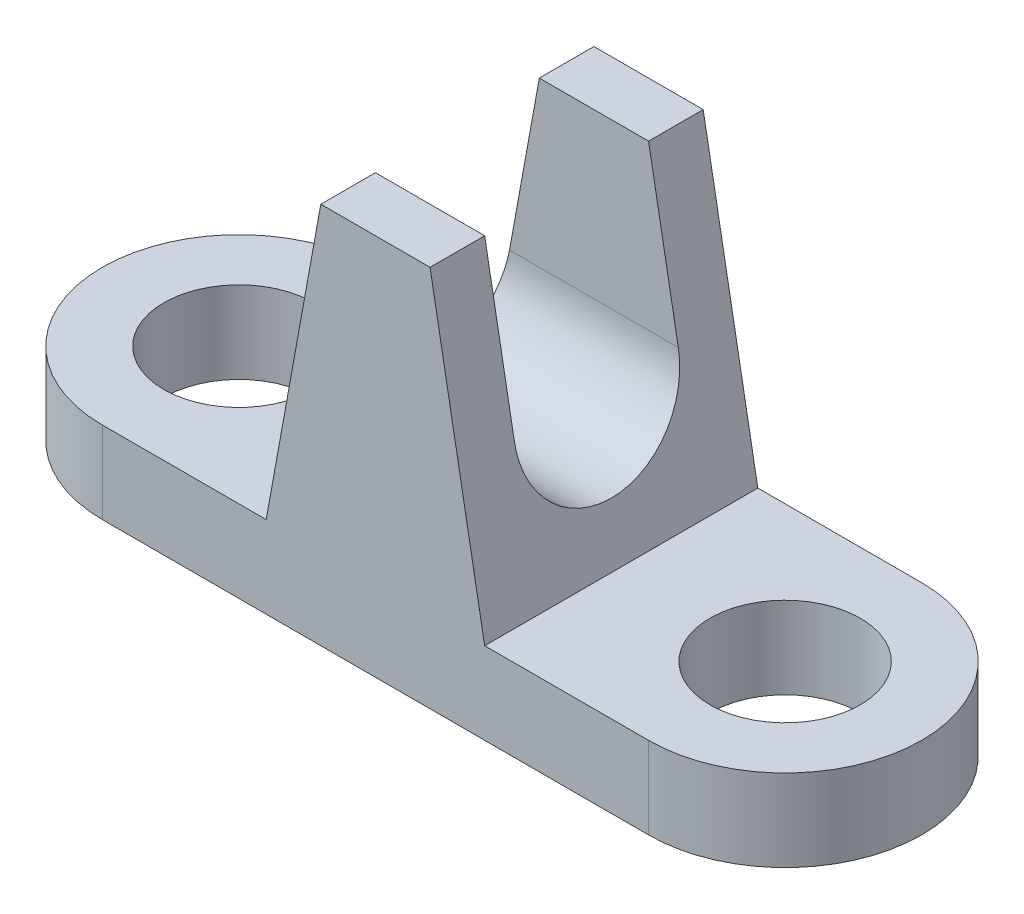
ISO-10303-21;
HEADER;
FILE_DESCRIPTION(('STEP AP214'),'2;1');
FILE_NAME('part.step','',(''),(''),'','','');
FILE_SCHEMA(('AUTOMOTIVE_DESIGN { 1 0 10303 214 1 1 1 1 }'));
ENDSEC;
DATA;
#1=APPLICATION_CONTEXT('core data for automotive mechanical design processes');
#2=APPLICATION_PROTOCOL_DEFINITION('international standard','automotive_design',2000,#1);
#3=PRODUCT_CONTEXT('',#1,'mechanical');
#4=PRODUCT('Part','Part','',(#3));
#5=PRODUCT_RELATED_PRODUCT_CATEGORY('part','',(#4));
#6=PRODUCT_DEFINITION_FORMATION('','',#4);
#7=PRODUCT_DEFINITION_CONTEXT('part definition',#1,'design');
#8=PRODUCT_DEFINITION('design','',#6,#7);
#9=PRODUCT_DEFINITION_SHAPE('','',#8);
#10=(LENGTH_UNIT() NAMED_UNIT(*) SI_UNIT(.MILLI.,.METRE.));
#11=(NAMED_UNIT(*) PLANE_ANGLE_UNIT() SI_UNIT($,.RADIAN.));
#12=(NAMED_UNIT(*) SI_UNIT($,.STERADIAN.) SOLID_ANGLE_UNIT());
#13=UNCERTAINTY_MEASURE_WITH_UNIT(LENGTH_MEASURE(1.E-05),#10,'distance_accuracy_value','');
#14=(GEOMETRIC_REPRESENTATION_CONTEXT(3) GLOBAL_UNCERTAINTY_ASSIGNED_CONTEXT((#13)) GLOBAL_UNIT_ASSIGNED_CONTEXT((#10,
#11,#12)) REPRESENTATION_CONTEXT('',''));
#15=CARTESIAN_POINT('',(0.,0.,0.));
#16=DIRECTION('',(0.,0.,1.));
#17=DIRECTION('',(1.,0.,0.));
#18=AXIS2_PLACEMENT_3D('',#15,#16,#17);
#19=CARTESIAN_POINT('',(8.,56.,20.));
#20=DIRECTION('',(0.,-1.,0.));
#21=DIRECTION('',(1.,0.,0.));
#22=AXIS2_PLACEMENT_3D('',#19,#20,#21);
#23=PLANE('',#22);
#24=DIRECTION('',(0.,0.,-1.));
#25=VECTOR('',#24,1.);
#26=CARTESIAN_POINT('',(8.,56.,20.));
#27=LINE('',#26,#25);
#28=CARTESIAN_POINT('',(8.,56.,20.));
#29=VERTEX_POINT('',#28);
#30=CARTESIAN_POINT('',(8.,56.,12.));
#31=VERTEX_POINT('',#30);
#32=EDGE_CURVE('E159',#29,#31,#27,.T.);
#33=ORIENTED_EDGE('',*,*,#32,.T.);
#34=DIRECTION('',(-1.,0.,0.));
#35=VECTOR('',#34,1.);
#36=CARTESIAN_POINT('',(8.,56.,12.));
#37=LINE('',#36,#35);
#38=CARTESIAN_POINT('',(-8.,56.,12.));
#39=VERTEX_POINT('',#38);
#40=EDGE_CURVE('E41',#31,#39,#37,.T.);
#41=ORIENTED_EDGE('',*,*,#40,.T.);
#42=DIRECTION('',(0.,0.,-1.));
#43=VECTOR('',#42,1.);
#44=CARTESIAN_POINT('',(-8.,56.,20.));
#45=LINE('',#44,#43);
#46=CARTESIAN_POINT('',(-8.,56.,20.));
#47=VERTEX_POINT('',#46);
#48=EDGE_CURVE('E156',#47,#39,#45,.T.);
#49=ORIENTED_EDGE('',*,*,#48,.F.);
#50=DIRECTION('',(-1.,0.,0.));
#51=VECTOR('',#50,1.);
#52=CARTESIAN_POINT('',(8.,56.,20.));
#53=LINE('',#52,#51);
#54=EDGE_CURVE('E152',#29,#47,#53,.T.);
#55=ORIENTED_EDGE('',*,*,#54,.F.);
#56=EDGE_LOOP('',(#33,#41,#49,#55));
#57=FACE_BOUND('',#56,.T.);
#58=ADVANCED_FACE('F33',(#57),#23,.F.);
#59=CARTESIAN_POINT('',(-40.,12.,0.));
#60=DIRECTION('',(0.,1.,0.));
#61=DIRECTION('',(0.,0.,1.));
#62=AXIS2_PLACEMENT_3D('',#59,#60,#61);
#63=PLANE('',#62);
#64=CARTESIAN_POINT('',(-40.,12.,0.));
#65=DIRECTION('',(0.,1.,0.));
#66=DIRECTION('',(0.,0.,1.));
#67=AXIS2_PLACEMENT_3D('',#64,#65,#66);
#68=CIRCLE('',#67,11.);
#69=CARTESIAN_POINT('',(-40.,12.,11.));
#70=VERTEX_POINT('',#69);
#71=EDGE_CURVE('E235',#70,#70,#68,.T.);
#72=ORIENTED_EDGE('',*,*,#71,.F.);
#73=EDGE_LOOP('',(#72));
#74=FACE_BOUND('',#73,.T.);
#75=DIRECTION('',(1.,0.,0.));
#76=VECTOR('',#75,1.);
#77=CARTESIAN_POINT('',(-40.,12.,20.));
#78=LINE('',#77,#76);
#79=CARTESIAN_POINT('',(-40.,12.,20.));
#80=VERTEX_POINT('',#79);
#81=CARTESIAN_POINT('',(-16.,12.,20.));
#82=VERTEX_POINT('',#81);
#83=EDGE_CURVE('E218',#80,#82,#78,.T.);
#84=ORIENTED_EDGE('',*,*,#83,.T.);
#85=DIRECTION('',(0.,0.,-1.));
#86=VECTOR('',#85,1.);
#87=CARTESIAN_POINT('',(-16.,12.,20.));
#88=LINE('',#87,#86);
#89=CARTESIAN_POINT('',(-16.,12.,-20.));
#90=VERTEX_POINT('',#89);
#91=EDGE_CURVE('E170',#82,#90,#88,.T.);
#92=ORIENTED_EDGE('',*,*,#91,.T.);
#93=DIRECTION('',(-1.,0.,0.));
#94=VECTOR('',#93,1.);
#95=CARTESIAN_POINT('',(-40.,12.,-20.));
#96=LINE('',#95,#94);
#97=CARTESIAN_POINT('',(-40.,12.,-20.));
#98=VERTEX_POINT('',#97);
#99=EDGE_CURVE('E196',#90,#98,#96,.T.);
#100=ORIENTED_EDGE('',*,*,#99,.T.);
#101=CARTESIAN_POINT('',(-40.,12.,0.));
#102=DIRECTION('',(0.,1.,0.));
#103=DIRECTION('',(0.,0.,1.));
#104=AXIS2_PLACEMENT_3D('',#101,#102,#103);
#105=CIRCLE('',#104,20.);
#106=EDGE_CURVE('E222',#98,#80,#105,.T.);
#107=ORIENTED_EDGE('',*,*,#106,.T.);
#108=EDGE_LOOP('',(#84,#92,#100,#107));
#109=FACE_BOUND('',#108,.T.);
#110=ADVANCED_FACE('F263',(#74,#109),#63,.T.);
#111=DIRECTION('',(0.,0.,-1.));
#112=VECTOR('',#111,1.);
#113=CARTESIAN_POINT('',(16.,12.,20.));
#114=LINE('',#113,#112);
#115=CARTESIAN_POINT('',(16.,12.,20.));
#116=VERTEX_POINT('',#115);
#117=CARTESIAN_POINT('',(16.,12.,-20.));
#118=VERTEX_POINT('',#117);
#119=EDGE_CURVE('E162',#116,#118,#114,.T.);
#120=ORIENTED_EDGE('',*,*,#119,.F.);
#121=CARTESIAN_POINT('',(40.,12.,20.));
#122=VERTEX_POINT('',#121);
#123=EDGE_CURVE('E219',#116,#122,#78,.T.);
#124=ORIENTED_EDGE('',*,*,#123,.T.);
#125=CARTESIAN_POINT('',(40.,12.,0.));
#126=DIRECTION('',(0.,1.,0.));
#127=DIRECTION('',(0.,0.,1.));
#128=AXIS2_PLACEMENT_3D('',#125,#126,#127);
#129=CIRCLE('',#128,20.);
#130=CARTESIAN_POINT('',(40.,12.,-20.));
#131=VERTEX_POINT('',#130);
#132=EDGE_CURVE('E200',#122,#131,#129,.T.);
#133=ORIENTED_EDGE('',*,*,#132,.T.);
#134=EDGE_CURVE('E199',#131,#118,#96,.T.);
#135=ORIENTED_EDGE('',*,*,#134,.T.);
#136=EDGE_LOOP('',(#120,#124,#133,#135));
#137=FACE_BOUND('',#136,.T.);
#138=CARTESIAN_POINT('',(40.,12.,0.));
#139=DIRECTION('',(0.,1.,0.));
#140=DIRECTION('',(0.,0.,1.));
#141=AXIS2_PLACEMENT_3D('',#138,#139,#140);
#142=CIRCLE('',#141,11.);
#143=CARTESIAN_POINT('',(40.,12.,11.));
#144=VERTEX_POINT('',#143);
#145=EDGE_CURVE('E241',#144,#144,#142,.T.);
#146=ORIENTED_EDGE('',*,*,#145,.F.);
#147=EDGE_LOOP('',(#146));
#148=FACE_BOUND('',#147,.T.);
#149=ADVANCED_FACE('F269',(#137,#148),#63,.T.);
#150=CARTESIAN_POINT('',(-40.,0.,0.));
#151=DIRECTION('',(0.,1.,0.));
#152=DIRECTION('',(0.,0.,1.));
#153=AXIS2_PLACEMENT_3D('',#150,#151,#152);
#154=PLANE('',#153);
#155=CARTESIAN_POINT('',(-40.,0.,0.));
#156=DIRECTION('',(0.,1.,0.));
#157=DIRECTION('',(0.,0.,1.));
#158=AXIS2_PLACEMENT_3D('',#155,#156,#157);
#159=CIRCLE('',#158,11.);
#160=CARTESIAN_POINT('',(-40.,0.,11.));
#161=VERTEX_POINT('',#160);
#162=EDGE_CURVE('E238',#161,#161,#159,.T.);
#163=ORIENTED_EDGE('',*,*,#162,.T.);
#164=EDGE_LOOP('',(#163));
#165=FACE_BOUND('',#164,.T.);
#166=CARTESIAN_POINT('',(-40.,0.,0.));
#167=DIRECTION('',(0.,1.,0.));
#168=DIRECTION('',(0.,0.,1.));
#169=AXIS2_PLACEMENT_3D('',#166,#167,#168);
#170=CIRCLE('',#169,20.);
#171=CARTESIAN_POINT('',(-40.,0.,-20.));
#172=VERTEX_POINT('',#171);
#173=CARTESIAN_POINT('',(-40.,0.,20.));
#174=VERTEX_POINT('',#173);
#175=EDGE_CURVE('E232',#172,#174,#170,.T.);
#176=ORIENTED_EDGE('',*,*,#175,.F.);
#177=DIRECTION('',(-1.,0.,0.));
#178=VECTOR('',#177,1.);
#179=CARTESIAN_POINT('',(-40.,0.,-20.));
#180=LINE('',#179,#178);
#181=CARTESIAN_POINT('',(40.,0.,-20.));
#182=VERTEX_POINT('',#181);
#183=EDGE_CURVE('E226',#182,#172,#180,.T.);
#184=ORIENTED_EDGE('',*,*,#183,.F.);
#185=CARTESIAN_POINT('',(40.,0.,0.));
#186=DIRECTION('',(0.,1.,0.));
#187=DIRECTION('',(0.,0.,1.));
#188=AXIS2_PLACEMENT_3D('',#185,#186,#187);
#189=CIRCLE('',#188,20.);
#190=CARTESIAN_POINT('',(40.,0.,20.));
#191=VERTEX_POINT('',#190);
#192=EDGE_CURVE('E228',#191,#182,#189,.T.);
#193=ORIENTED_EDGE('',*,*,#192,.F.);
#194=DIRECTION('',(1.,0.,0.));
#195=VECTOR('',#194,1.);
#196=CARTESIAN_POINT('',(-40.,0.,20.));
#197=LINE('',#196,#195);
#198=EDGE_CURVE('E230',#174,#191,#197,.T.);
#199=ORIENTED_EDGE('',*,*,#198,.F.);
#200=EDGE_LOOP('',(#176,#184,#193,#199));
#201=FACE_BOUND('',#200,.T.);
#202=CARTESIAN_POINT('',(40.,0.,0.));
#203=DIRECTION('',(0.,1.,0.));
#204=DIRECTION('',(0.,0.,1.));
#205=AXIS2_PLACEMENT_3D('',#202,#203,#204);
#206=CIRCLE('',#205,11.);
#207=CARTESIAN_POINT('',(40.,0.,11.));
#208=VERTEX_POINT('',#207);
#209=EDGE_CURVE('E193',#208,#208,#206,.T.);
#210=ORIENTED_EDGE('',*,*,#209,.T.);
#211=EDGE_LOOP('',(#210));
#212=FACE_BOUND('',#211,.T.);
#213=ADVANCED_FACE('F246',(#165,#201,#212),#154,.F.);
#214=CARTESIAN_POINT('',(-40.,12.,0.));
#215=DIRECTION('',(0.,-1.,0.));
#216=DIRECTION('',(0.,0.,-1.));
#217=AXIS2_PLACEMENT_3D('',#214,#215,#216);
#218=CYLINDRICAL_SURFACE('',#217,20.);
#219=ORIENTED_EDGE('',*,*,#175,.T.);
#220=DIRECTION('',(0.,-1.,0.));
#221=VECTOR('',#220,1.);
#222=CARTESIAN_POINT('',(-40.,12.,20.));
#223=LINE('',#222,#221);
#224=EDGE_CURVE('E180',#80,#174,#223,.T.);
#225=ORIENTED_EDGE('',*,*,#224,.F.);
#226=ORIENTED_EDGE('',*,*,#106,.F.);
#227=DIRECTION('',(0.,-1.,0.));
#228=VECTOR('',#227,1.);
#229=CARTESIAN_POINT('',(-40.,12.,-20.));
#230=LINE('',#229,#228);
#231=EDGE_CURVE('E206',#98,#172,#230,.T.);
#232=ORIENTED_EDGE('',*,*,#231,.T.);
#233=EDGE_LOOP('',(#219,#225,#226,#232));
#234=FACE_BOUND('',#233,.T.);
#235=ADVANCED_FACE('F35',(#234),#218,.T.);
#236=CARTESIAN_POINT('',(-40.,12.,20.));
#237=DIRECTION('',(0.,0.,-1.));
#238=DIRECTION('',(-1.,0.,0.));
#239=AXIS2_PLACEMENT_3D('',#236,#237,#238);
#240=PLANE('',#239);
#241=ORIENTED_EDGE('',*,*,#198,.T.);
#242=DIRECTION('',(0.,-1.,0.));
#243=VECTOR('',#242,1.);
#244=CARTESIAN_POINT('',(40.,12.,20.));
#245=LINE('',#244,#243);
#246=EDGE_CURVE('E213',#122,#191,#245,.T.);
#247=ORIENTED_EDGE('',*,*,#246,.F.);
#248=ORIENTED_EDGE('',*,*,#123,.F.);
#249=DIRECTION('',(-0.178885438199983,0.983869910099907,0.));
#250=VECTOR('',#249,1.);
#251=CARTESIAN_POINT('',(16.,12.,20.));
#252=LINE('',#251,#250);
#253=EDGE_CURVE('E155',#116,#29,#252,.T.);
#254=ORIENTED_EDGE('',*,*,#253,.T.);
#255=ORIENTED_EDGE('',*,*,#54,.T.);
#256=DIRECTION('',(-0.178885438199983,-0.983869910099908,0.));
#257=VECTOR('',#256,1.);
#258=CARTESIAN_POINT('',(-8.,56.,20.));
#259=LINE('',#258,#257);
#260=EDGE_CURVE('E151',#47,#82,#259,.T.);
#261=ORIENTED_EDGE('',*,*,#260,.T.);
#262=ORIENTED_EDGE('',*,*,#83,.F.);
#263=ORIENTED_EDGE('',*,*,#224,.T.);
#264=EDGE_LOOP('',(#241,#247,#248,#254,#255,#261,#262,#263));
#265=FACE_BOUND('',#264,.T.);
#266=ADVANCED_FACE('F292',(#265),#240,.F.);
#267=CARTESIAN_POINT('',(40.,12.,0.));
#268=DIRECTION('',(0.,-1.,0.));
#269=DIRECTION('',(0.,0.,-1.));
#270=AXIS2_PLACEMENT_3D('',#267,#268,#269);
#271=CYLINDRICAL_SURFACE('',#270,20.);
#272=ORIENTED_EDGE('',*,*,#192,.T.);
#273=DIRECTION('',(0.,-1.,0.));
#274=VECTOR('',#273,1.);
#275=CARTESIAN_POINT('',(40.,12.,-20.));
#276=LINE('',#275,#274);
#277=EDGE_CURVE('E210',#131,#182,#276,.T.);
#278=ORIENTED_EDGE('',*,*,#277,.F.);
#279=ORIENTED_EDGE('',*,*,#132,.F.);
#280=ORIENTED_EDGE('',*,*,#246,.T.);
#281=EDGE_LOOP('',(#272,#278,#279,#280));
#282=FACE_BOUND('',#281,.T.);
#283=ADVANCED_FACE('F301',(#282),#271,.T.);
#284=CARTESIAN_POINT('',(-40.,12.,-20.));
#285=DIRECTION('',(0.,0.,1.));
#286=DIRECTION('',(1.,0.,0.));
#287=AXIS2_PLACEMENT_3D('',#284,#285,#286);
#288=PLANE('',#287);
#289=ORIENTED_EDGE('',*,*,#183,.T.);
#290=ORIENTED_EDGE('',*,*,#231,.F.);
#291=ORIENTED_EDGE('',*,*,#99,.F.);
#292=DIRECTION('',(-0.178885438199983,-0.983869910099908,0.));
#293=VECTOR('',#292,1.);
#294=CARTESIAN_POINT('',(-8.,56.,-20.));
#295=LINE('',#294,#293);
#296=CARTESIAN_POINT('',(-8.,56.,-20.));
#297=VERTEX_POINT('',#296);
#298=EDGE_CURVE('E56',#297,#90,#295,.T.);
#299=ORIENTED_EDGE('',*,*,#298,.F.);
#300=DIRECTION('',(-1.,0.,0.));
#301=VECTOR('',#300,1.);
#302=CARTESIAN_POINT('',(8.,56.,-20.));
#303=LINE('',#302,#301);
#304=CARTESIAN_POINT('',(8.,56.,-20.));
#305=VERTEX_POINT('',#304);
#306=EDGE_CURVE('E148',#305,#297,#303,.T.);
#307=ORIENTED_EDGE('',*,*,#306,.F.);
#308=DIRECTION('',(-0.178885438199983,0.983869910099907,0.));
#309=VECTOR('',#308,1.);
#310=CARTESIAN_POINT('',(16.,12.,-20.));
#311=LINE('',#310,#309);
#312=EDGE_CURVE('E143',#118,#305,#311,.T.);
#313=ORIENTED_EDGE('',*,*,#312,.F.);
#314=ORIENTED_EDGE('',*,*,#134,.F.);
#315=ORIENTED_EDGE('',*,*,#277,.T.);
#316=EDGE_LOOP('',(#289,#290,#291,#299,#307,#313,#314,#315));
#317=FACE_BOUND('',#316,.T.);
#318=ADVANCED_FACE('F259',(#317),#288,.F.);
#319=CARTESIAN_POINT('',(-40.,12.,0.));
#320=DIRECTION('',(0.,-1.,0.));
#321=DIRECTION('',(0.,0.,-1.));
#322=AXIS2_PLACEMENT_3D('',#319,#320,#321);
#323=CYLINDRICAL_SURFACE('',#322,11.);
#324=ORIENTED_EDGE('',*,*,#71,.T.);
#325=EDGE_LOOP('',(#324));
#326=FACE_BOUND('',#325,.T.);
#327=ORIENTED_EDGE('',*,*,#162,.F.);
#328=EDGE_LOOP('',(#327));
#329=FACE_BOUND('',#328,.T.);
#330=ADVANCED_FACE('F250',(#326,#329),#323,.F.);
#331=CARTESIAN_POINT('',(40.,12.,0.));
#332=DIRECTION('',(0.,-1.,0.));
#333=DIRECTION('',(0.,0.,-1.));
#334=AXIS2_PLACEMENT_3D('',#331,#332,#333);
#335=CYLINDRICAL_SURFACE('',#334,11.);
#336=ORIENTED_EDGE('',*,*,#145,.T.);
#337=EDGE_LOOP('',(#336));
#338=FACE_BOUND('',#337,.T.);
#339=ORIENTED_EDGE('',*,*,#209,.F.);
#340=EDGE_LOOP('',(#339));
#341=FACE_BOUND('',#340,.T.);
#342=ADVANCED_FACE('F248',(#338,#341),#335,.F.);
#343=CARTESIAN_POINT('',(-8.,56.,20.));
#344=DIRECTION('',(0.983869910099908,-0.178885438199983,0.));
#345=DIRECTION('',(0.178885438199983,0.983869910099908,0.));
#346=AXIS2_PLACEMENT_3D('',#343,#344,#345);
#347=PLANE('',#346);
#348=ORIENTED_EDGE('',*,*,#48,.T.);
#349=DIRECTION('',(-0.178885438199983,-0.983869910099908,0.));
#350=VECTOR('',#349,1.);
#351=CARTESIAN_POINT('',(-8.,56.,12.));
#352=LINE('',#351,#350);
#353=CARTESIAN_POINT('',(-12.3636363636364,32.,12.));
#354=VERTEX_POINT('',#353);
#355=EDGE_CURVE('E141',#39,#354,#352,.T.);
#356=ORIENTED_EDGE('',*,*,#355,.T.);
#357=CARTESIAN_POINT('',(-12.3636363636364,32.,0.));
#358=DIRECTION('',(0.983869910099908,-0.178885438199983,0.));
#359=DIRECTION('',(0.178885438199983,0.983869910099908,0.));
#360=AXIS2_PLACEMENT_3D('',#357,#358,#359);
#361=ELLIPSE('',#360,12.1967344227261,12.);
#362=CARTESIAN_POINT('',(-12.3636363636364,32.,-12.));
#363=VERTEX_POINT('',#362);
#364=EDGE_CURVE('E134',#354,#363,#361,.T.);
#365=ORIENTED_EDGE('',*,*,#364,.T.);
#366=DIRECTION('',(0.178885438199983,0.983869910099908,0.));
#367=VECTOR('',#366,1.);
#368=CARTESIAN_POINT('',(-8.,56.,-12.));
#369=LINE('',#368,#367);
#370=CARTESIAN_POINT('',(-8.,56.,-12.));
#371=VERTEX_POINT('',#370);
#372=EDGE_CURVE('E122',#363,#371,#369,.T.);
#373=ORIENTED_EDGE('',*,*,#372,.T.);
#374=EDGE_CURVE('E154',#371,#297,#45,.T.);
#375=ORIENTED_EDGE('',*,*,#374,.T.);
#376=ORIENTED_EDGE('',*,*,#298,.T.);
#377=ORIENTED_EDGE('',*,*,#91,.F.);
#378=ORIENTED_EDGE('',*,*,#260,.F.);
#379=EDGE_LOOP('',(#348,#356,#365,#373,#375,#376,#377,#378));
#380=FACE_BOUND('',#379,.T.);
#381=ADVANCED_FACE('F140',(#380),#347,.F.);
#382=CARTESIAN_POINT('',(16.,12.,20.));
#383=DIRECTION('',(-0.983869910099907,-0.178885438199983,0.));
#384=DIRECTION('',(0.178885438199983,-0.983869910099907,0.));
#385=AXIS2_PLACEMENT_3D('',#382,#383,#384);
#386=PLANE('',#385);
#387=CARTESIAN_POINT('',(12.3636363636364,32.,0.));
#388=DIRECTION('',(-0.983869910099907,-0.178885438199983,0.));
#389=DIRECTION('',(0.178885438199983,-0.983869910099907,0.));
#390=AXIS2_PLACEMENT_3D('',#387,#388,#389);
#391=ELLIPSE('',#390,12.1967344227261,12.);
#392=CARTESIAN_POINT('',(12.3636363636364,32.,-12.));
#393=VERTEX_POINT('',#392);
#394=CARTESIAN_POINT('',(12.3636363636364,32.,12.));
#395=VERTEX_POINT('',#394);
#396=EDGE_CURVE('E11',#393,#395,#391,.T.);
#397=ORIENTED_EDGE('',*,*,#396,.T.);
#398=DIRECTION('',(-0.178885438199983,0.983869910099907,0.));
#399=VECTOR('',#398,1.);
#400=CARTESIAN_POINT('',(16.,12.,12.));
#401=LINE('',#400,#399);
#402=EDGE_CURVE('E129',#395,#31,#401,.T.);
#403=ORIENTED_EDGE('',*,*,#402,.T.);
#404=ORIENTED_EDGE('',*,*,#32,.F.);
#405=ORIENTED_EDGE('',*,*,#253,.F.);
#406=ORIENTED_EDGE('',*,*,#119,.T.);
#407=ORIENTED_EDGE('',*,*,#312,.T.);
#408=CARTESIAN_POINT('',(8.,56.,-12.));
#409=VERTEX_POINT('',#408);
#410=EDGE_CURVE('E158',#409,#305,#27,.T.);
#411=ORIENTED_EDGE('',*,*,#410,.F.);
#412=DIRECTION('',(0.178885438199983,-0.983869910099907,0.));
#413=VECTOR('',#412,1.);
#414=CARTESIAN_POINT('',(16.,12.,-12.));
#415=LINE('',#414,#413);
#416=EDGE_CURVE('E48',#409,#393,#415,.T.);
#417=ORIENTED_EDGE('',*,*,#416,.T.);
#418=EDGE_LOOP('',(#397,#403,#404,#405,#406,#407,#411,#417));
#419=FACE_BOUND('',#418,.T.);
#420=ADVANCED_FACE('F257',(#419),#386,.F.);
#421=ORIENTED_EDGE('',*,*,#374,.F.);
#422=DIRECTION('',(1.,0.,0.));
#423=VECTOR('',#422,1.);
#424=CARTESIAN_POINT('',(8.,56.,-12.));
#425=LINE('',#424,#423);
#426=EDGE_CURVE('E126',#371,#409,#425,.T.);
#427=ORIENTED_EDGE('',*,*,#426,.T.);
#428=ORIENTED_EDGE('',*,*,#410,.T.);
#429=ORIENTED_EDGE('',*,*,#306,.T.);
#430=EDGE_LOOP('',(#421,#427,#428,#429));
#431=FACE_BOUND('',#430,.T.);
#432=ADVANCED_FACE('F265',(#431),#23,.F.);
#433=CARTESIAN_POINT('',(-20.,32.,0.));
#434=DIRECTION('',(1.,0.,0.));
#435=DIRECTION('',(0.,0.,-1.));
#436=AXIS2_PLACEMENT_3D('',#433,#434,#435);
#437=CYLINDRICAL_SURFACE('',#436,12.);
#438=DIRECTION('',(1.,0.,0.));
#439=VECTOR('',#438,1.);
#440=CARTESIAN_POINT('',(-20.,32.,12.));
#441=LINE('',#440,#439);
#442=EDGE_CURVE('E136',#354,#395,#441,.T.);
#443=ORIENTED_EDGE('',*,*,#442,.T.);
#444=ORIENTED_EDGE('',*,*,#396,.F.);
#445=DIRECTION('',(1.,0.,0.));
#446=VECTOR('',#445,1.);
#447=CARTESIAN_POINT('',(-20.,32.,-12.));
#448=LINE('',#447,#446);
#449=EDGE_CURVE('E125',#363,#393,#448,.T.);
#450=ORIENTED_EDGE('',*,*,#449,.F.);
#451=ORIENTED_EDGE('',*,*,#364,.F.);
#452=EDGE_LOOP('',(#443,#444,#450,#451));
#453=FACE_BOUND('',#452,.T.);
#454=ADVANCED_FACE('F133',(#453),#437,.F.);
#455=CARTESIAN_POINT('',(-20.,32.,12.));
#456=DIRECTION('',(0.,0.,1.));
#457=DIRECTION('',(0.,-1.,0.));
#458=AXIS2_PLACEMENT_3D('',#455,#456,#457);
#459=PLANE('',#458);
#460=ORIENTED_EDGE('',*,*,#40,.F.);
#461=ORIENTED_EDGE('',*,*,#402,.F.);
#462=ORIENTED_EDGE('',*,*,#442,.F.);
#463=ORIENTED_EDGE('',*,*,#355,.F.);
#464=EDGE_LOOP('',(#460,#461,#462,#463));
#465=FACE_BOUND('',#464,.T.);
#466=ADVANCED_FACE('F280',(#465),#459,.F.);
#467=CARTESIAN_POINT('',(-20.,56.,-12.));
#468=DIRECTION('',(0.,0.,-1.));
#469=DIRECTION('',(0.,1.,0.));
#470=AXIS2_PLACEMENT_3D('',#467,#468,#469);
#471=PLANE('',#470);
#472=ORIENTED_EDGE('',*,*,#449,.T.);
#473=ORIENTED_EDGE('',*,*,#416,.F.);
#474=ORIENTED_EDGE('',*,*,#426,.F.);
#475=ORIENTED_EDGE('',*,*,#372,.F.);
#476=EDGE_LOOP('',(#472,#473,#474,#475));
#477=FACE_BOUND('',#476,.T.);
#478=ADVANCED_FACE('F124',(#477),#471,.F.);
#479=CLOSED_SHELL('',(#58,#110,#149,#213,#235,#266,#283,#318,#330,#342,#381,#420,#432,#454,#466,#478));
#480=MANIFOLD_SOLID_BREP('B2',#479);
#481=ADVANCED_BREP_SHAPE_REPRESENTATION('',(#18,#480),#14);
#482=SHAPE_DEFINITION_REPRESENTATION(#9,#481);
ENDSEC;
END-ISO-10303-21;
